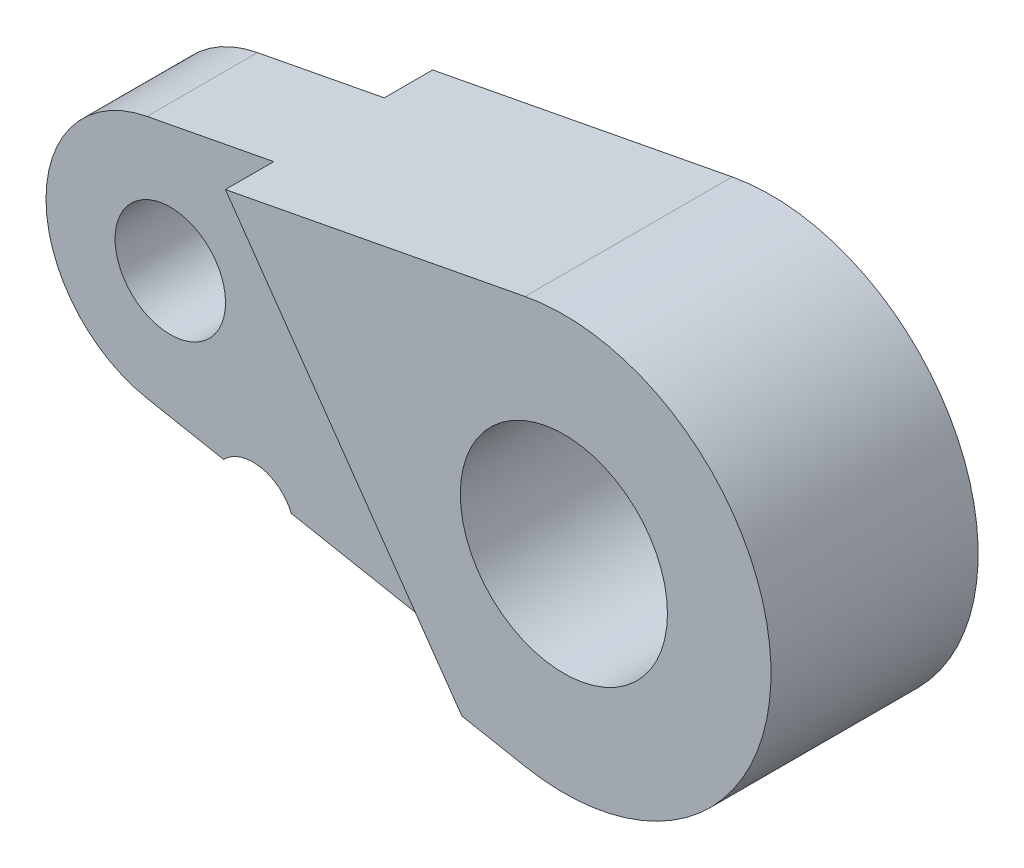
ISO-10303-21;
HEADER;
FILE_DESCRIPTION(('STEP AP214'),'2;1');
FILE_NAME('part.step','',(''),(''),'','','');
FILE_SCHEMA(('AUTOMOTIVE_DESIGN { 1 0 10303 214 1 1 1 1 }'));
ENDSEC;
DATA;
#1=APPLICATION_CONTEXT('core data for automotive mechanical design processes');
#2=APPLICATION_PROTOCOL_DEFINITION('international standard','automotive_design',2000,#1);
#3=PRODUCT_CONTEXT('',#1,'mechanical');
#4=PRODUCT('Part','Part','',(#3));
#5=PRODUCT_RELATED_PRODUCT_CATEGORY('part','',(#4));
#6=PRODUCT_DEFINITION_FORMATION('','',#4);
#7=PRODUCT_DEFINITION_CONTEXT('part definition',#1,'design');
#8=PRODUCT_DEFINITION('design','',#6,#7);
#9=PRODUCT_DEFINITION_SHAPE('','',#8);
#10=(LENGTH_UNIT() NAMED_UNIT(*) SI_UNIT(.MILLI.,.METRE.));
#11=(NAMED_UNIT(*) PLANE_ANGLE_UNIT() SI_UNIT($,.RADIAN.));
#12=(NAMED_UNIT(*) SI_UNIT($,.STERADIAN.) SOLID_ANGLE_UNIT());
#13=UNCERTAINTY_MEASURE_WITH_UNIT(LENGTH_MEASURE(1.E-05),#10,'distance_accuracy_value','');
#14=(GEOMETRIC_REPRESENTATION_CONTEXT(3) GLOBAL_UNCERTAINTY_ASSIGNED_CONTEXT((#13)) GLOBAL_UNIT_ASSIGNED_CONTEXT((#10,
#11,#12)) REPRESENTATION_CONTEXT('',''));
#15=CARTESIAN_POINT('',(0.,0.,0.));
#16=DIRECTION('',(0.,0.,1.));
#17=DIRECTION('',(1.,0.,0.));
#18=AXIS2_PLACEMENT_3D('',#15,#16,#17);
#19=CARTESIAN_POINT('',(-33.6875,-8.84038142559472,7.5));
#20=DIRECTION('',(0.1875,0.982264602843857,0.));
#21=DIRECTION('',(-0.982264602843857,0.1875,0.));
#22=AXIS2_PLACEMENT_3D('',#19,#20,#21);
#23=PLANE('',#22);
#24=DIRECTION('',(0.982264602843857,-0.1875,0.));
#25=VECTOR('',#24,1.);
#26=CARTESIAN_POINT('',(-33.6875,-8.84038142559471,-4.));
#27=LINE('',#26,#25);
#28=CARTESIAN_POINT('',(-33.6875,-8.84038142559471,-4.));
#29=VERTEX_POINT('',#28);
#30=CARTESIAN_POINT('',(-28.141482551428,-9.89903534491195,-4.));
#31=VERTEX_POINT('',#30);
#32=EDGE_CURVE('E447',#29,#31,#27,.T.);
#33=ORIENTED_EDGE('',*,*,#32,.T.);
#34=DIRECTION('',(0.,0.,1.));
#35=VECTOR('',#34,1.);
#36=CARTESIAN_POINT('',(-28.1414825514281,-9.89903534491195,-7.5));
#37=LINE('',#36,#35);
#38=CARTESIAN_POINT('',(-28.1414825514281,-9.89903534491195,4.));
#39=VERTEX_POINT('',#38);
#40=EDGE_CURVE('E367',#31,#39,#37,.T.);
#41=ORIENTED_EDGE('',*,*,#40,.T.);
#42=DIRECTION('',(0.982264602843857,-0.1875,0.));
#43=VECTOR('',#42,1.);
#44=CARTESIAN_POINT('',(-33.6875,-8.84038142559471,4.));
#45=LINE('',#44,#43);
#46=CARTESIAN_POINT('',(-33.6875,-8.84038142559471,4.));
#47=VERTEX_POINT('',#46);
#48=EDGE_CURVE('E471',#47,#39,#45,.T.);
#49=ORIENTED_EDGE('',*,*,#48,.F.);
#50=DIRECTION('',(0.,0.,-1.));
#51=VECTOR('',#50,1.);
#52=CARTESIAN_POINT('',(-33.6875,-8.84038142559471,7.5));
#53=LINE('',#52,#51);
#54=EDGE_CURVE('E498',#47,#29,#53,.T.);
#55=ORIENTED_EDGE('',*,*,#54,.T.);
#56=EDGE_LOOP('',(#33,#41,#49,#55));
#57=FACE_BOUND('',#56,.T.);
#58=ADVANCED_FACE('F353',(#57),#23,.F.);
#59=CARTESIAN_POINT('',(-32.,0.,7.5));
#60=DIRECTION('',(0.,0.,-1.));
#61=DIRECTION('',(-1.,0.,0.));
#62=AXIS2_PLACEMENT_3D('',#59,#60,#61);
#63=CYLINDRICAL_SURFACE('',#62,9.);
#64=CARTESIAN_POINT('',(-32.,0.,-4.));
#65=DIRECTION('',(0.,0.,1.));
#66=DIRECTION('',(1.,0.,0.));
#67=AXIS2_PLACEMENT_3D('',#64,#65,#66);
#68=CIRCLE('',#67,9.);
#69=CARTESIAN_POINT('',(-33.6875,8.84038142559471,-4.));
#70=VERTEX_POINT('',#69);
#71=EDGE_CURVE('E449',#70,#29,#68,.T.);
#72=ORIENTED_EDGE('',*,*,#71,.T.);
#73=ORIENTED_EDGE('',*,*,#54,.F.);
#74=CARTESIAN_POINT('',(-32.,0.,4.));
#75=DIRECTION('',(0.,0.,1.));
#76=DIRECTION('',(1.,0.,0.));
#77=AXIS2_PLACEMENT_3D('',#74,#75,#76);
#78=CIRCLE('',#77,9.);
#79=CARTESIAN_POINT('',(-33.6875,8.84038142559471,4.));
#80=VERTEX_POINT('',#79);
#81=EDGE_CURVE('E469',#80,#47,#78,.T.);
#82=ORIENTED_EDGE('',*,*,#81,.F.);
#83=DIRECTION('',(0.,0.,-1.));
#84=VECTOR('',#83,1.);
#85=CARTESIAN_POINT('',(-33.6875,8.84038142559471,7.5));
#86=LINE('',#85,#84);
#87=EDGE_CURVE('E501',#80,#70,#86,.T.);
#88=ORIENTED_EDGE('',*,*,#87,.T.);
#89=EDGE_LOOP('',(#72,#73,#82,#88));
#90=FACE_BOUND('',#89,.T.);
#91=ADVANCED_FACE('F548',(#90),#63,.T.);
#92=CARTESIAN_POINT('',(-33.6875,8.84038142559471,7.5));
#93=DIRECTION('',(0.1875,-0.982264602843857,0.));
#94=DIRECTION('',(0.982264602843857,0.1875,0.));
#95=AXIS2_PLACEMENT_3D('',#92,#93,#94);
#96=PLANE('',#95);
#97=DIRECTION('',(0.,0.,-1.));
#98=VECTOR('',#97,1.);
#99=CARTESIAN_POINT('',(-24.5078875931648,10.5926356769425,-4.));
#100=LINE('',#99,#98);
#101=CARTESIAN_POINT('',(-24.5078875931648,10.5926356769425,-4.));
#102=VERTEX_POINT('',#101);
#103=CARTESIAN_POINT('',(-24.5078875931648,10.5926356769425,-7.5));
#104=VERTEX_POINT('',#103);
#105=EDGE_CURVE('E375',#102,#104,#100,.T.);
#106=ORIENTED_EDGE('',*,*,#105,.F.);
#107=DIRECTION('',(-0.982264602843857,-0.1875,0.));
#108=VECTOR('',#107,1.);
#109=CARTESIAN_POINT('',(-24.5078875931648,10.5926356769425,-4.));
#110=LINE('',#109,#108);
#111=EDGE_CURVE('E456',#102,#70,#110,.T.);
#112=ORIENTED_EDGE('',*,*,#111,.T.);
#113=ORIENTED_EDGE('',*,*,#87,.F.);
#114=DIRECTION('',(-0.982264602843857,-0.1875,0.));
#115=VECTOR('',#114,1.);
#116=CARTESIAN_POINT('',(-24.5078875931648,10.5926356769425,4.));
#117=LINE('',#116,#115);
#118=CARTESIAN_POINT('',(-24.5078875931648,10.5926356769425,4.));
#119=VERTEX_POINT('',#118);
#120=EDGE_CURVE('E467',#119,#80,#117,.T.);
#121=ORIENTED_EDGE('',*,*,#120,.F.);
#122=DIRECTION('',(0.,0.,1.));
#123=VECTOR('',#122,1.);
#124=CARTESIAN_POINT('',(-24.5078875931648,10.5926356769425,4.));
#125=LINE('',#124,#123);
#126=CARTESIAN_POINT('',(-24.5078875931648,10.5926356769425,7.5));
#127=VERTEX_POINT('',#126);
#128=EDGE_CURVE('E474',#119,#127,#125,.T.);
#129=ORIENTED_EDGE('',*,*,#128,.T.);
#130=DIRECTION('',(-0.982264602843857,-0.1875,0.));
#131=VECTOR('',#130,1.);
#132=CARTESIAN_POINT('',(-33.6875,8.84038142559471,7.5));
#133=LINE('',#132,#131);
#134=CARTESIAN_POINT('',(-2.8125,14.7339690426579,7.5));
#135=VERTEX_POINT('',#134);
#136=EDGE_CURVE('E490',#135,#127,#133,.T.);
#137=ORIENTED_EDGE('',*,*,#136,.F.);
#138=DIRECTION('',(0.,0.,-1.));
#139=VECTOR('',#138,1.);
#140=CARTESIAN_POINT('',(-2.8125,14.7339690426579,7.5));
#141=LINE('',#140,#139);
#142=CARTESIAN_POINT('',(-2.8125,14.7339690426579,-7.5));
#143=VERTEX_POINT('',#142);
#144=EDGE_CURVE('E361',#135,#143,#141,.T.);
#145=ORIENTED_EDGE('',*,*,#144,.T.);
#146=DIRECTION('',(-0.982264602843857,-0.1875,0.));
#147=VECTOR('',#146,1.);
#148=CARTESIAN_POINT('',(-33.6875,8.84038142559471,-7.5));
#149=LINE('',#148,#147);
#150=EDGE_CURVE('E482',#143,#104,#149,.T.);
#151=ORIENTED_EDGE('',*,*,#150,.T.);
#152=EDGE_LOOP('',(#106,#112,#113,#121,#129,#137,#145,#151));
#153=FACE_BOUND('',#152,.T.);
#154=ADVANCED_FACE('F526',(#153),#96,.F.);
#155=CARTESIAN_POINT('',(-23.2352017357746,-10.8355728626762,4.));
#156=VERTEX_POINT('',#155);
#157=CARTESIAN_POINT('',(-7.38519130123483,-13.8611089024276,4.));
#158=VERTEX_POINT('',#157);
#159=EDGE_CURVE('E441',#156,#158,#45,.T.);
#160=ORIENTED_EDGE('',*,*,#159,.F.);
#161=DIRECTION('',(0.,0.,1.));
#162=VECTOR('',#161,1.);
#163=CARTESIAN_POINT('',(-23.2352017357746,-10.8355728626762,-7.5));
#164=LINE('',#163,#162);
#165=CARTESIAN_POINT('',(-23.2352017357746,-10.8355728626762,-4.));
#166=VERTEX_POINT('',#165);
#167=EDGE_CURVE('E429',#156,#166,#164,.F.);
#168=ORIENTED_EDGE('',*,*,#167,.T.);
#169=CARTESIAN_POINT('',(-7.38519130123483,-13.8611089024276,-4.));
#170=VERTEX_POINT('',#169);
#171=EDGE_CURVE('E438',#166,#170,#27,.T.);
#172=ORIENTED_EDGE('',*,*,#171,.T.);
#173=DIRECTION('',(0.,0.,-1.));
#174=VECTOR('',#173,1.);
#175=CARTESIAN_POINT('',(-7.38519130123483,-13.8611089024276,-4.));
#176=LINE('',#175,#174);
#177=CARTESIAN_POINT('',(-7.38519130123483,-13.8611089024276,-7.5));
#178=VERTEX_POINT('',#177);
#179=EDGE_CURVE('E459',#170,#178,#176,.T.);
#180=ORIENTED_EDGE('',*,*,#179,.T.);
#181=DIRECTION('',(0.982264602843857,-0.1875,0.));
#182=VECTOR('',#181,1.);
#183=CARTESIAN_POINT('',(-33.6875,-8.84038142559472,-7.5));
#184=LINE('',#183,#182);
#185=CARTESIAN_POINT('',(-2.8125,-14.7339690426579,-7.5));
#186=VERTEX_POINT('',#185);
#187=EDGE_CURVE('E485',#178,#186,#184,.T.);
#188=ORIENTED_EDGE('',*,*,#187,.T.);
#189=DIRECTION('',(0.,0.,-1.));
#190=VECTOR('',#189,1.);
#191=CARTESIAN_POINT('',(-2.8125,-14.7339690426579,7.5));
#192=LINE('',#191,#190);
#193=CARTESIAN_POINT('',(-2.8125,-14.7339690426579,7.5));
#194=VERTEX_POINT('',#193);
#195=EDGE_CURVE('E495',#194,#186,#192,.T.);
#196=ORIENTED_EDGE('',*,*,#195,.F.);
#197=DIRECTION('',(0.982264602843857,-0.1875,0.));
#198=VECTOR('',#197,1.);
#199=CARTESIAN_POINT('',(-33.6875,-8.84038142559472,7.5));
#200=LINE('',#199,#198);
#201=CARTESIAN_POINT('',(-7.38519130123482,-13.8611089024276,7.5));
#202=VERTEX_POINT('',#201);
#203=EDGE_CURVE('E493',#202,#194,#200,.T.);
#204=ORIENTED_EDGE('',*,*,#203,.F.);
#205=DIRECTION('',(0.,0.,1.));
#206=VECTOR('',#205,1.);
#207=CARTESIAN_POINT('',(-7.38519130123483,-13.8611089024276,4.));
#208=LINE('',#207,#206);
#209=EDGE_CURVE('E475',#158,#202,#208,.T.);
#210=ORIENTED_EDGE('',*,*,#209,.F.);
#211=EDGE_LOOP('',(#160,#168,#172,#180,#188,#196,#204,#210));
#212=FACE_BOUND('',#211,.T.);
#213=ADVANCED_FACE('F436',(#212),#23,.F.);
#214=CARTESIAN_POINT('',(0.,0.,-7.5));
#215=DIRECTION('',(0.,0.,1.));
#216=DIRECTION('',(1.,0.,0.));
#217=AXIS2_PLACEMENT_3D('',#214,#215,#216);
#218=PLANE('',#217);
#219=CARTESIAN_POINT('',(0.,0.,-7.5));
#220=DIRECTION('',(0.,0.,1.));
#221=DIRECTION('',(1.,0.,0.));
#222=AXIS2_PLACEMENT_3D('',#219,#220,#221);
#223=CIRCLE('',#222,7.5);
#224=CARTESIAN_POINT('',(7.5,0.,-7.5));
#225=VERTEX_POINT('',#224);
#226=EDGE_CURVE('E519',#225,#225,#223,.T.);
#227=ORIENTED_EDGE('',*,*,#226,.T.);
#228=EDGE_LOOP('',(#227));
#229=FACE_BOUND('',#228,.T.);
#230=DIRECTION('',(-0.57357643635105,0.819152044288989,0.));
#231=VECTOR('',#230,1.);
#232=CARTESIAN_POINT('',(-7.38519130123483,-13.8611089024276,-7.5));
#233=LINE('',#232,#231);
#234=EDGE_CURVE('E450',#178,#104,#233,.T.);
#235=ORIENTED_EDGE('',*,*,#234,.T.);
#236=ORIENTED_EDGE('',*,*,#150,.F.);
#237=CARTESIAN_POINT('',(0.,0.,-7.5));
#238=DIRECTION('',(0.,0.,1.));
#239=DIRECTION('',(1.,0.,0.));
#240=AXIS2_PLACEMENT_3D('',#237,#238,#239);
#241=CIRCLE('',#240,15.);
#242=EDGE_CURVE('E477',#186,#143,#241,.T.);
#243=ORIENTED_EDGE('',*,*,#242,.F.);
#244=ORIENTED_EDGE('',*,*,#187,.F.);
#245=EDGE_LOOP('',(#235,#236,#243,#244));
#246=FACE_BOUND('',#245,.T.);
#247=ADVANCED_FACE('F523',(#229,#246),#218,.F.);
#248=CARTESIAN_POINT('',(0.,0.,7.5));
#249=DIRECTION('',(0.,0.,-1.));
#250=DIRECTION('',(-1.,0.,0.));
#251=AXIS2_PLACEMENT_3D('',#248,#249,#250);
#252=CYLINDRICAL_SURFACE('',#251,15.);
#253=ORIENTED_EDGE('',*,*,#242,.T.);
#254=ORIENTED_EDGE('',*,*,#144,.F.);
#255=CARTESIAN_POINT('',(0.,0.,7.5));
#256=DIRECTION('',(0.,0.,1.));
#257=DIRECTION('',(1.,0.,0.));
#258=AXIS2_PLACEMENT_3D('',#255,#256,#257);
#259=CIRCLE('',#258,15.);
#260=EDGE_CURVE('E487',#194,#135,#259,.T.);
#261=ORIENTED_EDGE('',*,*,#260,.F.);
#262=ORIENTED_EDGE('',*,*,#195,.T.);
#263=EDGE_LOOP('',(#253,#254,#261,#262));
#264=FACE_BOUND('',#263,.T.);
#265=ADVANCED_FACE('F355',(#264),#252,.T.);
#266=CARTESIAN_POINT('',(0.,0.,7.5));
#267=DIRECTION('',(0.,0.,1.));
#268=DIRECTION('',(1.,0.,0.));
#269=AXIS2_PLACEMENT_3D('',#266,#267,#268);
#270=PLANE('',#269);
#271=CARTESIAN_POINT('',(0.,0.,7.5));
#272=DIRECTION('',(0.,0.,1.));
#273=DIRECTION('',(1.,0.,0.));
#274=AXIS2_PLACEMENT_3D('',#271,#272,#273);
#275=CIRCLE('',#274,7.5);
#276=CARTESIAN_POINT('',(7.5,0.,7.5));
#277=VERTEX_POINT('',#276);
#278=EDGE_CURVE('E512',#277,#277,#275,.T.);
#279=ORIENTED_EDGE('',*,*,#278,.F.);
#280=EDGE_LOOP('',(#279));
#281=FACE_BOUND('',#280,.T.);
#282=DIRECTION('',(-0.57357643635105,0.819152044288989,0.));
#283=VECTOR('',#282,1.);
#284=CARTESIAN_POINT('',(-7.38519130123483,-13.8611089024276,7.5));
#285=LINE('',#284,#283);
#286=EDGE_CURVE('E461',#202,#127,#285,.T.);
#287=ORIENTED_EDGE('',*,*,#286,.F.);
#288=ORIENTED_EDGE('',*,*,#203,.T.);
#289=ORIENTED_EDGE('',*,*,#260,.T.);
#290=ORIENTED_EDGE('',*,*,#136,.T.);
#291=EDGE_LOOP('',(#287,#288,#289,#290));
#292=FACE_BOUND('',#291,.T.);
#293=ADVANCED_FACE('F575',(#281,#292),#270,.T.);
#294=CARTESIAN_POINT('',(-7.38519130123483,-13.8611089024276,4.));
#295=DIRECTION('',(0.819152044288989,0.57357643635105,0.));
#296=DIRECTION('',(-0.57357643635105,0.819152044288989,0.));
#297=AXIS2_PLACEMENT_3D('',#294,#295,#296);
#298=PLANE('',#297);
#299=ORIENTED_EDGE('',*,*,#286,.T.);
#300=ORIENTED_EDGE('',*,*,#128,.F.);
#301=DIRECTION('',(-0.57357643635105,0.819152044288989,0.));
#302=VECTOR('',#301,1.);
#303=CARTESIAN_POINT('',(-7.38519130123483,-13.8611089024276,4.));
#304=LINE('',#303,#302);
#305=EDGE_CURVE('E464',#158,#119,#304,.T.);
#306=ORIENTED_EDGE('',*,*,#305,.F.);
#307=ORIENTED_EDGE('',*,*,#209,.T.);
#308=EDGE_LOOP('',(#299,#300,#306,#307));
#309=FACE_BOUND('',#308,.T.);
#310=ADVANCED_FACE('F544',(#309),#298,.F.);
#311=CARTESIAN_POINT('',(-32.,0.,4.));
#312=DIRECTION('',(0.,0.,1.));
#313=DIRECTION('',(1.,0.,0.));
#314=AXIS2_PLACEMENT_3D('',#311,#312,#313);
#315=PLANE('',#314);
#316=CARTESIAN_POINT('',(-26.,-12.,4.));
#317=DIRECTION('',(0.,0.,1.));
#318=DIRECTION('',(1.,0.,0.));
#319=AXIS2_PLACEMENT_3D('',#316,#317,#318);
#320=CIRCLE('',#319,3.);
#321=EDGE_CURVE('E508',#156,#39,#320,.T.);
#322=ORIENTED_EDGE('',*,*,#321,.F.);
#323=ORIENTED_EDGE('',*,*,#159,.T.);
#324=ORIENTED_EDGE('',*,*,#305,.T.);
#325=ORIENTED_EDGE('',*,*,#120,.T.);
#326=ORIENTED_EDGE('',*,*,#81,.T.);
#327=ORIENTED_EDGE('',*,*,#48,.T.);
#328=EDGE_LOOP('',(#322,#323,#324,#325,#326,#327));
#329=FACE_BOUND('',#328,.T.);
#330=CARTESIAN_POINT('',(-32.,0.,4.));
#331=DIRECTION('',(0.,0.,1.));
#332=DIRECTION('',(1.,0.,0.));
#333=AXIS2_PLACEMENT_3D('',#330,#331,#332);
#334=CIRCLE('',#333,4.);
#335=CARTESIAN_POINT('',(-28.,0.,4.));
#336=VERTEX_POINT('',#335);
#337=EDGE_CURVE('E507',#336,#336,#334,.T.);
#338=ORIENTED_EDGE('',*,*,#337,.F.);
#339=EDGE_LOOP('',(#338));
#340=FACE_BOUND('',#339,.T.);
#341=ADVANCED_FACE('F534',(#329,#340),#315,.T.);
#342=CARTESIAN_POINT('',(-7.38519130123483,-13.8611089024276,-4.));
#343=DIRECTION('',(-0.819152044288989,-0.57357643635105,0.));
#344=DIRECTION('',(0.57357643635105,-0.819152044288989,0.));
#345=AXIS2_PLACEMENT_3D('',#342,#343,#344);
#346=PLANE('',#345);
#347=ORIENTED_EDGE('',*,*,#234,.F.);
#348=ORIENTED_EDGE('',*,*,#179,.F.);
#349=DIRECTION('',(-0.57357643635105,0.819152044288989,0.));
#350=VECTOR('',#349,1.);
#351=CARTESIAN_POINT('',(-7.38519130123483,-13.8611089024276,-4.));
#352=LINE('',#351,#350);
#353=EDGE_CURVE('E446',#170,#102,#352,.T.);
#354=ORIENTED_EDGE('',*,*,#353,.T.);
#355=ORIENTED_EDGE('',*,*,#105,.T.);
#356=EDGE_LOOP('',(#347,#348,#354,#355));
#357=FACE_BOUND('',#356,.T.);
#358=ADVANCED_FACE('F532',(#357),#346,.T.);
#359=CARTESIAN_POINT('',(-32.,0.,-4.));
#360=DIRECTION('',(0.,0.,-1.));
#361=DIRECTION('',(1.,0.,0.));
#362=AXIS2_PLACEMENT_3D('',#359,#360,#361);
#363=PLANE('',#362);
#364=CARTESIAN_POINT('',(-26.,-12.,-4.));
#365=DIRECTION('',(0.,0.,-1.));
#366=DIRECTION('',(-1.,0.,0.));
#367=AXIS2_PLACEMENT_3D('',#364,#365,#366);
#368=CIRCLE('',#367,3.);
#369=EDGE_CURVE('E11',#31,#166,#368,.T.);
#370=ORIENTED_EDGE('',*,*,#369,.F.);
#371=ORIENTED_EDGE('',*,*,#32,.F.);
#372=ORIENTED_EDGE('',*,*,#71,.F.);
#373=ORIENTED_EDGE('',*,*,#111,.F.);
#374=ORIENTED_EDGE('',*,*,#353,.F.);
#375=ORIENTED_EDGE('',*,*,#171,.F.);
#376=EDGE_LOOP('',(#370,#371,#372,#373,#374,#375));
#377=FACE_BOUND('',#376,.T.);
#378=CARTESIAN_POINT('',(-32.,0.,-4.));
#379=DIRECTION('',(0.,0.,-1.));
#380=DIRECTION('',(-1.,0.,0.));
#381=AXIS2_PLACEMENT_3D('',#378,#379,#380);
#382=CIRCLE('',#381,4.);
#383=CARTESIAN_POINT('',(-36.,0.,-4.));
#384=VERTEX_POINT('',#383);
#385=EDGE_CURVE('E505',#384,#384,#382,.T.);
#386=ORIENTED_EDGE('',*,*,#385,.F.);
#387=EDGE_LOOP('',(#386));
#388=FACE_BOUND('',#387,.T.);
#389=ADVANCED_FACE('F444',(#377,#388),#363,.T.);
#390=CARTESIAN_POINT('',(0.,0.,-7.5));
#391=DIRECTION('',(0.,0.,1.));
#392=DIRECTION('',(1.,0.,0.));
#393=AXIS2_PLACEMENT_3D('',#390,#391,#392);
#394=CYLINDRICAL_SURFACE('',#393,7.5);
#395=ORIENTED_EDGE('',*,*,#226,.F.);
#396=EDGE_LOOP('',(#395));
#397=FACE_BOUND('',#396,.T.);
#398=ORIENTED_EDGE('',*,*,#278,.T.);
#399=EDGE_LOOP('',(#398));
#400=FACE_BOUND('',#399,.T.);
#401=ADVANCED_FACE('F541',(#397,#400),#394,.F.);
#402=CARTESIAN_POINT('',(-32.,0.,-7.5));
#403=DIRECTION('',(0.,0.,1.));
#404=DIRECTION('',(1.,0.,0.));
#405=AXIS2_PLACEMENT_3D('',#402,#403,#404);
#406=CYLINDRICAL_SURFACE('',#405,4.);
#407=ORIENTED_EDGE('',*,*,#337,.T.);
#408=EDGE_LOOP('',(#407));
#409=FACE_BOUND('',#408,.T.);
#410=ORIENTED_EDGE('',*,*,#385,.T.);
#411=EDGE_LOOP('',(#410));
#412=FACE_BOUND('',#411,.T.);
#413=ADVANCED_FACE('F596',(#409,#412),#406,.F.);
#414=CARTESIAN_POINT('',(-26.,-12.,-7.5));
#415=DIRECTION('',(0.,0.,1.));
#416=DIRECTION('',(1.,0.,0.));
#417=AXIS2_PLACEMENT_3D('',#414,#415,#416);
#418=CYLINDRICAL_SURFACE('',#417,3.);
#419=ORIENTED_EDGE('',*,*,#321,.T.);
#420=ORIENTED_EDGE('',*,*,#40,.F.);
#421=ORIENTED_EDGE('',*,*,#369,.T.);
#422=ORIENTED_EDGE('',*,*,#167,.F.);
#423=EDGE_LOOP('',(#419,#420,#421,#422));
#424=FACE_BOUND('',#423,.T.);
#425=ADVANCED_FACE('F428',(#424),#418,.F.);
#426=CLOSED_SHELL('',(#58,#91,#154,#213,#247,#265,#293,#310,#341,#358,#389,#401,#413,#425));
#427=MANIFOLD_SOLID_BREP('B2',#426);
#428=ADVANCED_BREP_SHAPE_REPRESENTATION('',(#18,#427),#14);
#429=SHAPE_DEFINITION_REPRESENTATION(#9,#428);
ENDSEC;
END-ISO-10303-21;
